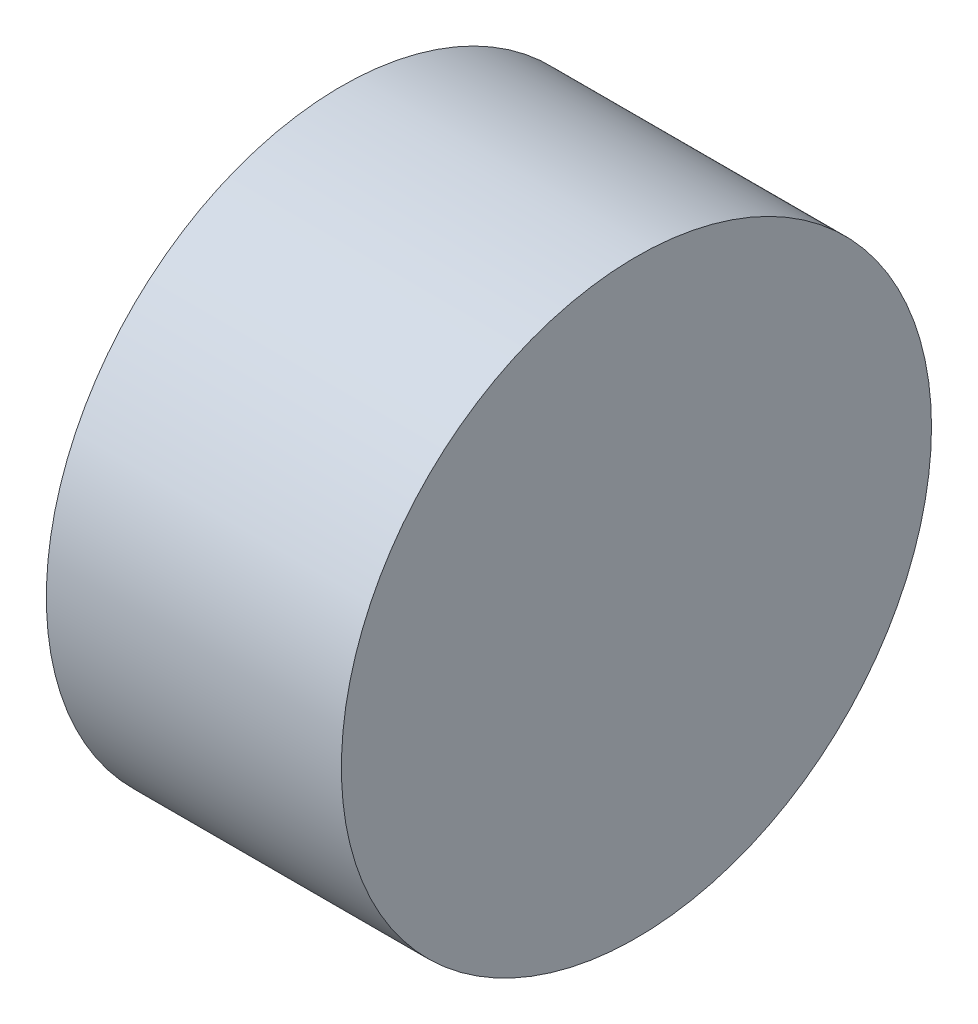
ISO-10303-21;
HEADER;
FILE_DESCRIPTION(('STEP AP214'),'2;1');
FILE_NAME('part.step','',(''),(''),'','','');
FILE_SCHEMA(('AUTOMOTIVE_DESIGN { 1 0 10303 214 1 1 1 1 }'));
ENDSEC;
DATA;
#1=APPLICATION_CONTEXT('core data for automotive mechanical design processes');
#2=APPLICATION_PROTOCOL_DEFINITION('international standard','automotive_design',2000,#1);
#3=PRODUCT_CONTEXT('',#1,'mechanical');
#4=PRODUCT('Part','Part','',(#3));
#5=PRODUCT_RELATED_PRODUCT_CATEGORY('part','',(#4));
#6=PRODUCT_DEFINITION_FORMATION('','',#4);
#7=PRODUCT_DEFINITION_CONTEXT('part definition',#1,'design');
#8=PRODUCT_DEFINITION('design','',#6,#7);
#9=PRODUCT_DEFINITION_SHAPE('','',#8);
#10=(LENGTH_UNIT() NAMED_UNIT(*) SI_UNIT(.MILLI.,.METRE.));
#11=(NAMED_UNIT(*) PLANE_ANGLE_UNIT() SI_UNIT($,.RADIAN.));
#12=(NAMED_UNIT(*) SI_UNIT($,.STERADIAN.) SOLID_ANGLE_UNIT());
#13=UNCERTAINTY_MEASURE_WITH_UNIT(LENGTH_MEASURE(1.E-05),#10,'distance_accuracy_value','');
#14=(GEOMETRIC_REPRESENTATION_CONTEXT(3) GLOBAL_UNCERTAINTY_ASSIGNED_CONTEXT((#13)) GLOBAL_UNIT_ASSIGNED_CONTEXT((#10,
#11,#12)) REPRESENTATION_CONTEXT('',''));
#15=CARTESIAN_POINT('',(0.,0.,0.));
#16=DIRECTION('',(0.,0.,1.));
#17=DIRECTION('',(1.,0.,0.));
#18=AXIS2_PLACEMENT_3D('',#15,#16,#17);
#19=CARTESIAN_POINT('',(0.,0.,0.));
#20=DIRECTION('',(1.,0.,0.));
#21=DIRECTION('',(0.,0.,-1.));
#22=AXIS2_PLACEMENT_3D('',#19,#20,#21);
#23=PLANE('',#22);
#24=CARTESIAN_POINT('',(0.,0.,0.));
#25=DIRECTION('',(1.,0.,0.));
#26=DIRECTION('',(0.,0.,-1.));
#27=AXIS2_PLACEMENT_3D('',#24,#25,#26);
#28=CIRCLE('',#27,30.);
#29=CARTESIAN_POINT('',(0.,0.,-30.));
#30=VERTEX_POINT('',#29);
#31=EDGE_CURVE('E10',#30,#30,#28,.T.);
#32=ORIENTED_EDGE('',*,*,#31,.F.);
#33=EDGE_LOOP('',(#32));
#34=FACE_BOUND('',#33,.T.);
#35=CARTESIAN_POINT('',(0.,0.,0.));
#36=DIRECTION('',(1.,0.,0.));
#37=DIRECTION('',(0.,0.,-1.));
#38=AXIS2_PLACEMENT_3D('',#35,#36,#37);
#39=CIRCLE('',#38,2.5);
#40=CARTESIAN_POINT('',(0.,0.,-2.5));
#41=VERTEX_POINT('',#40);
#42=EDGE_CURVE('E47',#41,#41,#39,.T.);
#43=ORIENTED_EDGE('',*,*,#42,.T.);
#44=EDGE_LOOP('',(#43));
#45=FACE_BOUND('',#44,.T.);
#46=ADVANCED_FACE('F39',(#34,#45),#23,.F.);
#47=CARTESIAN_POINT('',(10.,0.,0.));
#48=DIRECTION('',(-1.,0.,0.));
#49=DIRECTION('',(0.,0.,1.));
#50=AXIS2_PLACEMENT_3D('',#47,#48,#49);
#51=CYLINDRICAL_SURFACE('',#50,30.);
#52=ORIENTED_EDGE('',*,*,#31,.T.);
#53=EDGE_LOOP('',(#52));
#54=FACE_BOUND('',#53,.T.);
#55=CARTESIAN_POINT('',(30.,0.,0.));
#56=DIRECTION('',(1.,0.,0.));
#57=DIRECTION('',(0.,0.,-1.));
#58=AXIS2_PLACEMENT_3D('',#55,#56,#57);
#59=CIRCLE('',#58,30.);
#60=CARTESIAN_POINT('',(30.,0.,-30.));
#61=VERTEX_POINT('',#60);
#62=EDGE_CURVE('E57',#61,#61,#59,.T.);
#63=ORIENTED_EDGE('',*,*,#62,.F.);
#64=EDGE_LOOP('',(#63));
#65=FACE_BOUND('',#64,.T.);
#66=ADVANCED_FACE('F41',(#54,#65),#51,.T.);
#67=CARTESIAN_POINT('',(10.,0.,0.));
#68=DIRECTION('',(-1.,0.,0.));
#69=DIRECTION('',(0.,0.,1.));
#70=AXIS2_PLACEMENT_3D('',#67,#68,#69);
#71=CYLINDRICAL_SURFACE('',#70,2.5);
#72=CARTESIAN_POINT('',(10.,0.,0.));
#73=DIRECTION('',(1.,0.,0.));
#74=DIRECTION('',(0.,0.,-1.));
#75=AXIS2_PLACEMENT_3D('',#72,#73,#74);
#76=CIRCLE('',#75,2.5);
#77=CARTESIAN_POINT('',(10.,0.,-2.5));
#78=VERTEX_POINT('',#77);
#79=EDGE_CURVE('E52',#78,#78,#76,.T.);
#80=ORIENTED_EDGE('',*,*,#79,.T.);
#81=EDGE_LOOP('',(#80));
#82=FACE_BOUND('',#81,.T.);
#83=ORIENTED_EDGE('',*,*,#42,.F.);
#84=EDGE_LOOP('',(#83));
#85=FACE_BOUND('',#84,.T.);
#86=ADVANCED_FACE('F67',(#82,#85),#71,.F.);
#87=CARTESIAN_POINT('',(10.,0.,0.));
#88=DIRECTION('',(1.,0.,0.));
#89=DIRECTION('',(0.,0.,-1.));
#90=AXIS2_PLACEMENT_3D('',#87,#88,#89);
#91=PLANE('',#90);
#92=ORIENTED_EDGE('',*,*,#79,.F.);
#93=EDGE_LOOP('',(#92));
#94=FACE_BOUND('',#93,.T.);
#95=ADVANCED_FACE('F72',(#94),#91,.F.);
#96=CARTESIAN_POINT('',(30.,0.,0.));
#97=DIRECTION('',(1.,0.,0.));
#98=DIRECTION('',(0.,0.,-1.));
#99=AXIS2_PLACEMENT_3D('',#96,#97,#98);
#100=PLANE('',#99);
#101=ORIENTED_EDGE('',*,*,#62,.T.);
#102=EDGE_LOOP('',(#101));
#103=FACE_BOUND('',#102,.T.);
#104=ADVANCED_FACE('F64',(#103),#100,.T.);
#105=CLOSED_SHELL('',(#46,#66,#86,#95,#104));
#106=MANIFOLD_SOLID_BREP('B2',#105);
#107=ADVANCED_BREP_SHAPE_REPRESENTATION('',(#18,#106),#14);
#108=SHAPE_DEFINITION_REPRESENTATION(#9,#107);
ENDSEC;
END-ISO-10303-21;
